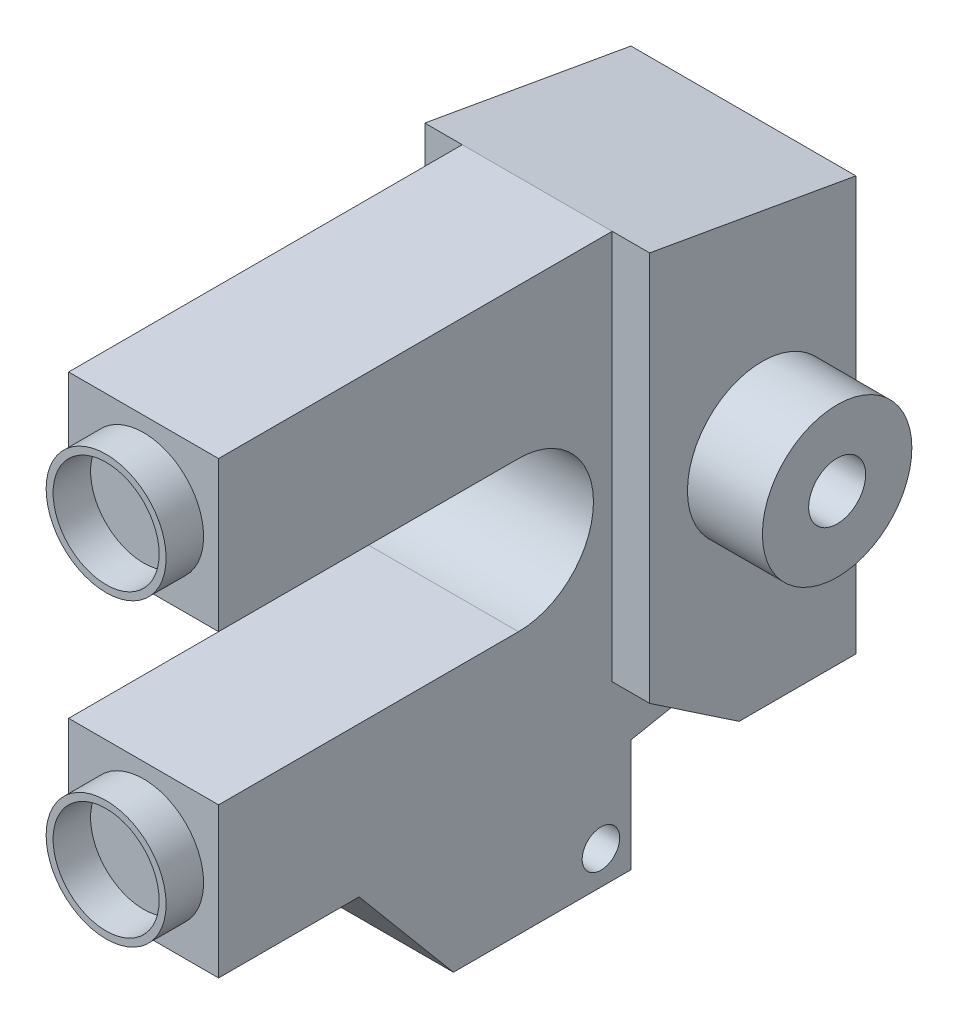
ISO-10303-21;
HEADER;
FILE_DESCRIPTION(('STEP AP214'),'2;1');
FILE_NAME('part.step','',(''),(''),'','','');
FILE_SCHEMA(('AUTOMOTIVE_DESIGN { 1 0 10303 214 1 1 1 1 }'));
ENDSEC;
DATA;
#1=APPLICATION_CONTEXT('core data for automotive mechanical design processes');
#2=APPLICATION_PROTOCOL_DEFINITION('international standard','automotive_design',2000,#1);
#3=PRODUCT_CONTEXT('',#1,'mechanical');
#4=PRODUCT('Part','Part','',(#3));
#5=PRODUCT_RELATED_PRODUCT_CATEGORY('part','',(#4));
#6=PRODUCT_DEFINITION_FORMATION('','',#4);
#7=PRODUCT_DEFINITION_CONTEXT('part definition',#1,'design');
#8=PRODUCT_DEFINITION('design','',#6,#7);
#9=PRODUCT_DEFINITION_SHAPE('','',#8);
#10=(LENGTH_UNIT() NAMED_UNIT(*) SI_UNIT(.MILLI.,.METRE.));
#11=(NAMED_UNIT(*) PLANE_ANGLE_UNIT() SI_UNIT($,.RADIAN.));
#12=(NAMED_UNIT(*) SI_UNIT($,.STERADIAN.) SOLID_ANGLE_UNIT());
#13=UNCERTAINTY_MEASURE_WITH_UNIT(LENGTH_MEASURE(1.E-05),#10,'distance_accuracy_value','');
#14=(GEOMETRIC_REPRESENTATION_CONTEXT(3) GLOBAL_UNCERTAINTY_ASSIGNED_CONTEXT((#13)) GLOBAL_UNIT_ASSIGNED_CONTEXT((#10,
#11,#12)) REPRESENTATION_CONTEXT('',''));
#15=CARTESIAN_POINT('',(0.,0.,0.));
#16=DIRECTION('',(0.,0.,1.));
#17=DIRECTION('',(1.,0.,0.));
#18=AXIS2_PLACEMENT_3D('',#15,#16,#17);
#19=CARTESIAN_POINT('',(6.35,0.,0.));
#20=DIRECTION('',(0.,0.,-1.));
#21=DIRECTION('',(-1.,0.,0.));
#22=AXIS2_PLACEMENT_3D('',#19,#20,#21);
#23=PLANE('',#22);
#24=DIRECTION('',(0.,-1.,0.));
#25=VECTOR('',#24,1.);
#26=CARTESIAN_POINT('',(6.35,0.,0.));
#27=LINE('',#26,#25);
#28=CARTESIAN_POINT('',(6.35,12.7,0.));
#29=VERTEX_POINT('',#28);
#30=CARTESIAN_POINT('',(6.35,0.,0.));
#31=VERTEX_POINT('',#30);
#32=EDGE_CURVE('E667',#29,#31,#27,.T.);
#33=ORIENTED_EDGE('',*,*,#32,.F.);
#34=DIRECTION('',(1.,0.,0.));
#35=VECTOR('',#34,1.);
#36=CARTESIAN_POINT('',(-6.35,12.7,0.));
#37=LINE('',#36,#35);
#38=CARTESIAN_POINT('',(-6.35,12.7,0.));
#39=VERTEX_POINT('',#38);
#40=EDGE_CURVE('E331',#39,#29,#37,.T.);
#41=ORIENTED_EDGE('',*,*,#40,.F.);
#42=DIRECTION('',(0.,-1.,0.));
#43=VECTOR('',#42,1.);
#44=CARTESIAN_POINT('',(-6.35,0.,0.));
#45=LINE('',#44,#43);
#46=CARTESIAN_POINT('',(-6.35,0.,0.));
#47=VERTEX_POINT('',#46);
#48=EDGE_CURVE('E396',#39,#47,#45,.T.);
#49=ORIENTED_EDGE('',*,*,#48,.T.);
#50=DIRECTION('',(-1.,0.,0.));
#51=VECTOR('',#50,1.);
#52=CARTESIAN_POINT('',(6.35,0.,0.));
#53=LINE('',#52,#51);
#54=EDGE_CURVE('E399',#31,#47,#53,.T.);
#55=ORIENTED_EDGE('',*,*,#54,.F.);
#56=EDGE_LOOP('',(#33,#41,#49,#55));
#57=FACE_BOUND('',#56,.T.);
#58=CARTESIAN_POINT('',(0.,6.35,0.));
#59=DIRECTION('',(0.,0.,-1.));
#60=DIRECTION('',(-1.,0.,0.));
#61=AXIS2_PLACEMENT_3D('',#58,#59,#60);
#62=CIRCLE('',#61,5.08);
#63=CARTESIAN_POINT('',(-5.08,6.35,0.));
#64=VERTEX_POINT('',#63);
#65=EDGE_CURVE('E11',#64,#64,#62,.F.);
#66=ORIENTED_EDGE('',*,*,#65,.F.);
#67=EDGE_LOOP('',(#66));
#68=FACE_BOUND('',#67,.T.);
#69=ADVANCED_FACE('F34',(#57,#68),#23,.F.);
#70=CARTESIAN_POINT('',(-6.35,38.1,0.));
#71=VERTEX_POINT('',#70);
#72=CARTESIAN_POINT('',(-6.35,25.4,0.));
#73=VERTEX_POINT('',#72);
#74=EDGE_CURVE('E352',#71,#73,#45,.T.);
#75=ORIENTED_EDGE('',*,*,#74,.T.);
#76=DIRECTION('',(1.,0.,0.));
#77=VECTOR('',#76,1.);
#78=CARTESIAN_POINT('',(-6.35,25.4,0.));
#79=LINE('',#78,#77);
#80=CARTESIAN_POINT('',(6.35,25.4,0.));
#81=VERTEX_POINT('',#80);
#82=EDGE_CURVE('E339',#73,#81,#79,.T.);
#83=ORIENTED_EDGE('',*,*,#82,.T.);
#84=CARTESIAN_POINT('',(6.35,38.1,0.));
#85=VERTEX_POINT('',#84);
#86=EDGE_CURVE('E403',#85,#81,#27,.T.);
#87=ORIENTED_EDGE('',*,*,#86,.F.);
#88=DIRECTION('',(-1.,0.,0.));
#89=VECTOR('',#88,1.);
#90=CARTESIAN_POINT('',(6.35,38.1,0.));
#91=LINE('',#90,#89);
#92=EDGE_CURVE('E402',#85,#71,#91,.T.);
#93=ORIENTED_EDGE('',*,*,#92,.T.);
#94=EDGE_LOOP('',(#75,#83,#87,#93));
#95=FACE_BOUND('',#94,.T.);
#96=CARTESIAN_POINT('',(0.,31.75,0.));
#97=DIRECTION('',(0.,0.,-1.));
#98=DIRECTION('',(-1.,0.,0.));
#99=AXIS2_PLACEMENT_3D('',#96,#97,#98);
#100=CIRCLE('',#99,5.08);
#101=CARTESIAN_POINT('',(-5.08,31.75,0.));
#102=VERTEX_POINT('',#101);
#103=EDGE_CURVE('E42',#102,#102,#100,.F.);
#104=ORIENTED_EDGE('',*,*,#103,.F.);
#105=EDGE_LOOP('',(#104));
#106=FACE_BOUND('',#105,.T.);
#107=ADVANCED_FACE('F480',(#95,#106),#23,.F.);
#108=CARTESIAN_POINT('',(6.35,0.,-34.925));
#109=DIRECTION('',(0.,0.,1.));
#110=DIRECTION('',(1.,0.,0.));
#111=AXIS2_PLACEMENT_3D('',#108,#109,#110);
#112=PLANE('',#111);
#113=DIRECTION('',(-1.,0.,0.));
#114=VECTOR('',#113,1.);
#115=CARTESIAN_POINT('',(6.35,-9.525,-34.925));
#116=LINE('',#115,#114);
#117=CARTESIAN_POINT('',(6.35,-9.525,-34.925));
#118=VERTEX_POINT('',#117);
#119=CARTESIAN_POINT('',(3.17500000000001,-9.525,-34.925));
#120=VERTEX_POINT('',#119);
#121=EDGE_CURVE('E415',#118,#120,#116,.T.);
#122=ORIENTED_EDGE('',*,*,#121,.T.);
#123=DIRECTION('',(0.,-1.,0.));
#124=VECTOR('',#123,1.);
#125=CARTESIAN_POINT('',(3.17500000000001,1.5875,-34.925));
#126=LINE('',#125,#124);
#127=CARTESIAN_POINT('',(3.17500000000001,0.,-34.925));
#128=VERTEX_POINT('',#127);
#129=EDGE_CURVE('E247',#128,#120,#126,.T.);
#130=ORIENTED_EDGE('',*,*,#129,.F.);
#131=DIRECTION('',(-1.,0.,0.));
#132=VECTOR('',#131,1.);
#133=CARTESIAN_POINT('',(6.35,0.,-34.925));
#134=LINE('',#133,#132);
#135=CARTESIAN_POINT('',(6.35,0.,-34.925));
#136=VERTEX_POINT('',#135);
#137=EDGE_CURVE('E410',#136,#128,#134,.T.);
#138=ORIENTED_EDGE('',*,*,#137,.F.);
#139=DIRECTION('',(0.,1.,0.));
#140=VECTOR('',#139,1.);
#141=CARTESIAN_POINT('',(6.35,0.,-34.925));
#142=LINE('',#141,#140);
#143=EDGE_CURVE('E356',#118,#136,#142,.T.);
#144=ORIENTED_EDGE('',*,*,#143,.F.);
#145=EDGE_LOOP('',(#122,#130,#138,#144));
#146=FACE_BOUND('',#145,.T.);
#147=ADVANCED_FACE('F460',(#146),#112,.F.);
#148=CARTESIAN_POINT('',(-9.525,35.0208900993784,-50.8));
#149=DIRECTION('',(1.,0.,0.));
#150=DIRECTION('',(0.,0.,1.));
#151=AXIS2_PLACEMENT_3D('',#148,#149,#150);
#152=PLANE('',#151);
#153=DIRECTION('',(0.,0.173648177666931,0.984807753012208));
#154=VECTOR('',#153,1.);
#155=CARTESIAN_POINT('',(-9.525,38.1,-33.3375));
#156=LINE('',#155,#154);
#157=CARTESIAN_POINT('',(-9.525,35.0208900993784,-50.8));
#158=VERTEX_POINT('',#157);
#159=CARTESIAN_POINT('',(-9.525,38.1,-33.3375));
#160=VERTEX_POINT('',#159);
#161=EDGE_CURVE('E260',#158,#160,#156,.T.);
#162=ORIENTED_EDGE('',*,*,#161,.F.);
#163=DIRECTION('',(0.,1.,0.));
#164=VECTOR('',#163,1.);
#165=CARTESIAN_POINT('',(-9.525,35.0208900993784,-50.8));
#166=LINE('',#165,#164);
#167=CARTESIAN_POINT('',(-9.525,-0.0451519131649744,-50.8));
#168=VERTEX_POINT('',#167);
#169=EDGE_CURVE('E263',#168,#158,#166,.T.);
#170=ORIENTED_EDGE('',*,*,#169,.F.);
#171=DIRECTION('',(0.,0.,-1.));
#172=VECTOR('',#171,1.);
#173=CARTESIAN_POINT('',(-9.525,-0.0451519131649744,-40.9066319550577));
#174=LINE('',#173,#172);
#175=CARTESIAN_POINT('',(-9.525,-0.0451519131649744,-40.9066319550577));
#176=VERTEX_POINT('',#175);
#177=EDGE_CURVE('E267',#176,#168,#174,.T.);
#178=ORIENTED_EDGE('',*,*,#177,.F.);
#179=DIRECTION('',(0.,-0.559192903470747,-0.829037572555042));
#180=VECTOR('',#179,1.);
#181=CARTESIAN_POINT('',(-9.525,5.06029205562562,-33.3375));
#182=LINE('',#181,#180);
#183=CARTESIAN_POINT('',(-9.525,5.06029205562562,-33.3375));
#184=VERTEX_POINT('',#183);
#185=EDGE_CURVE('E270',#184,#176,#182,.T.);
#186=ORIENTED_EDGE('',*,*,#185,.F.);
#187=DIRECTION('',(0.,-1.,0.));
#188=VECTOR('',#187,1.);
#189=CARTESIAN_POINT('',(-9.525,38.1,-33.3375));
#190=LINE('',#189,#188);
#191=EDGE_CURVE('E273',#160,#184,#190,.T.);
#192=ORIENTED_EDGE('',*,*,#191,.F.);
#193=EDGE_LOOP('',(#162,#170,#178,#186,#192));
#194=FACE_BOUND('',#193,.T.);
#195=CARTESIAN_POINT('',(-9.525,19.05,-42.8625));
#196=DIRECTION('',(1.,0.,0.));
#197=DIRECTION('',(0.,0.,-1.));
#198=AXIS2_PLACEMENT_3D('',#195,#196,#197);
#199=CIRCLE('',#198,6.35);
#200=CARTESIAN_POINT('',(-9.525,19.05,-49.2125));
#201=VERTEX_POINT('',#200);
#202=EDGE_CURVE('E381',#201,#201,#199,.F.);
#203=ORIENTED_EDGE('',*,*,#202,.F.);
#204=EDGE_LOOP('',(#203));
#205=FACE_BOUND('',#204,.T.);
#206=ADVANCED_FACE('F548',(#194,#205),#152,.F.);
#207=CARTESIAN_POINT('',(-6.35,0.,0.));
#208=DIRECTION('',(-1.,0.,0.));
#209=DIRECTION('',(0.,0.,1.));
#210=AXIS2_PLACEMENT_3D('',#207,#208,#209);
#211=PLANE('',#210);
#212=CARTESIAN_POINT('',(-6.35,-6.69796522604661,-32.3839750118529));
#213=DIRECTION('',(-1.,0.,0.));
#214=DIRECTION('',(0.,0.,1.));
#215=AXIS2_PLACEMENT_3D('',#212,#213,#214);
#216=CIRCLE('',#215,1.58750000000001);
#217=CARTESIAN_POINT('',(-6.35,-6.69796522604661,-30.7964750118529));
#218=VERTEX_POINT('',#217);
#219=EDGE_CURVE('E237',#218,#218,#216,.T.);
#220=ORIENTED_EDGE('',*,*,#219,.F.);
#221=EDGE_LOOP('',(#220));
#222=FACE_BOUND('',#221,.T.);
#223=DIRECTION('',(0.,0.,1.));
#224=VECTOR('',#223,1.);
#225=CARTESIAN_POINT('',(-6.35,38.1,0.));
#226=LINE('',#225,#224);
#227=CARTESIAN_POINT('',(-6.35,38.1,-33.3375));
#228=VERTEX_POINT('',#227);
#229=EDGE_CURVE('E393',#228,#71,#226,.T.);
#230=ORIENTED_EDGE('',*,*,#229,.F.);
#231=DIRECTION('',(0.,-1.,0.));
#232=VECTOR('',#231,1.);
#233=CARTESIAN_POINT('',(-6.35,38.1,-33.3375));
#234=LINE('',#233,#232);
#235=CARTESIAN_POINT('',(-6.35,5.06029205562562,-33.3375));
#236=VERTEX_POINT('',#235);
#237=EDGE_CURVE('E264',#228,#236,#234,.T.);
#238=ORIENTED_EDGE('',*,*,#237,.T.);
#239=DIRECTION('',(0.,-0.559192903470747,-0.829037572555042));
#240=VECTOR('',#239,1.);
#241=CARTESIAN_POINT('',(-6.35,5.06029205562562,-33.3375));
#242=LINE('',#241,#240);
#243=CARTESIAN_POINT('',(-6.35,0.892498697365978,-39.5165077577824));
#244=VERTEX_POINT('',#243);
#245=EDGE_CURVE('E452',#236,#244,#242,.T.);
#246=ORIENTED_EDGE('',*,*,#245,.T.);
#247=DIRECTION('',(0.,0.190808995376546,-0.981627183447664));
#248=VECTOR('',#247,1.);
#249=CARTESIAN_POINT('',(-6.35,3.0857874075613,-50.8));
#250=LINE('',#249,#248);
#251=CARTESIAN_POINT('',(-6.35,0.,-34.925));
#252=VERTEX_POINT('',#251);
#253=EDGE_CURVE('E386',#252,#244,#250,.T.);
#254=ORIENTED_EDGE('',*,*,#253,.F.);
#255=DIRECTION('',(0.,1.,0.));
#256=VECTOR('',#255,1.);
#257=CARTESIAN_POINT('',(-6.35,0.,-34.925));
#258=LINE('',#257,#256);
#259=CARTESIAN_POINT('',(-6.35,-9.525,-34.925));
#260=VERTEX_POINT('',#259);
#261=EDGE_CURVE('E387',#260,#252,#258,.T.);
#262=ORIENTED_EDGE('',*,*,#261,.F.);
#263=DIRECTION('',(0.,0.,-1.));
#264=VECTOR('',#263,1.);
#265=CARTESIAN_POINT('',(-6.35,-9.525,-34.925));
#266=LINE('',#265,#264);
#267=CARTESIAN_POINT('',(-6.35,-9.525,-19.889951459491));
#268=VERTEX_POINT('',#267);
#269=EDGE_CURVE('E437',#268,#260,#266,.T.);
#270=ORIENTED_EDGE('',*,*,#269,.F.);
#271=DIRECTION('',(0.,-0.766044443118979,-0.642787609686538));
#272=VECTOR('',#271,1.);
#273=CARTESIAN_POINT('',(-6.35,-9.525,-19.889951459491));
#274=LINE('',#273,#272);
#275=CARTESIAN_POINT('',(-6.35,0.,-11.8975274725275));
#276=VERTEX_POINT('',#275);
#277=EDGE_CURVE('E429',#276,#268,#274,.T.);
#278=ORIENTED_EDGE('',*,*,#277,.F.);
#279=DIRECTION('',(0.,0.,-1.));
#280=VECTOR('',#279,1.);
#281=CARTESIAN_POINT('',(-6.35,0.,-11.8975274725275));
#282=LINE('',#281,#280);
#283=EDGE_CURVE('E342',#47,#276,#282,.T.);
#284=ORIENTED_EDGE('',*,*,#283,.F.);
#285=ORIENTED_EDGE('',*,*,#48,.F.);
#286=DIRECTION('',(0.,0.,-1.));
#287=VECTOR('',#286,1.);
#288=CARTESIAN_POINT('',(-6.35,12.7,0.));
#289=LINE('',#288,#287);
#290=CARTESIAN_POINT('',(-6.35,12.7,-25.4));
#291=VERTEX_POINT('',#290);
#292=EDGE_CURVE('E321',#39,#291,#289,.T.);
#293=ORIENTED_EDGE('',*,*,#292,.T.);
#294=CARTESIAN_POINT('',(-6.35,19.05,-25.4));
#295=DIRECTION('',(1.,0.,0.));
#296=DIRECTION('',(0.,0.,-1.));
#297=AXIS2_PLACEMENT_3D('',#294,#295,#296);
#298=CIRCLE('',#297,6.35);
#299=CARTESIAN_POINT('',(-6.35,25.4,-25.4));
#300=VERTEX_POINT('',#299);
#301=EDGE_CURVE('E324',#291,#300,#298,.T.);
#302=ORIENTED_EDGE('',*,*,#301,.T.);
#303=DIRECTION('',(0.,0.,1.));
#304=VECTOR('',#303,1.);
#305=CARTESIAN_POINT('',(-6.35,25.4,0.));
#306=LINE('',#305,#304);
#307=EDGE_CURVE('E328',#300,#73,#306,.T.);
#308=ORIENTED_EDGE('',*,*,#307,.T.);
#309=ORIENTED_EDGE('',*,*,#74,.F.);
#310=EDGE_LOOP('',(#230,#238,#246,#254,#262,#270,#278,#284,#285,#293,#302,#308,#309));
#311=FACE_BOUND('',#310,.T.);
#312=ADVANCED_FACE('F450',(#222,#311),#211,.T.);
#313=CARTESIAN_POINT('',(9.525,35.0208900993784,-50.8));
#314=DIRECTION('',(-1.,0.,0.));
#315=DIRECTION('',(0.,0.,1.));
#316=AXIS2_PLACEMENT_3D('',#313,#314,#315);
#317=PLANE('',#316);
#318=DIRECTION('',(0.,0.173648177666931,0.984807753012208));
#319=VECTOR('',#318,1.);
#320=CARTESIAN_POINT('',(9.525,38.1,-33.3375));
#321=LINE('',#320,#319);
#322=CARTESIAN_POINT('',(9.525,35.0208900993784,-50.8));
#323=VERTEX_POINT('',#322);
#324=CARTESIAN_POINT('',(9.525,38.1,-33.3375));
#325=VERTEX_POINT('',#324);
#326=EDGE_CURVE('E290',#323,#325,#321,.T.);
#327=ORIENTED_EDGE('',*,*,#326,.T.);
#328=DIRECTION('',(0.,-1.,0.));
#329=VECTOR('',#328,1.);
#330=CARTESIAN_POINT('',(9.525,38.1,-33.3375));
#331=LINE('',#330,#329);
#332=CARTESIAN_POINT('',(9.525,5.06029205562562,-33.3375));
#333=VERTEX_POINT('',#332);
#334=EDGE_CURVE('E293',#325,#333,#331,.T.);
#335=ORIENTED_EDGE('',*,*,#334,.T.);
#336=DIRECTION('',(0.,-0.559192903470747,-0.829037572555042));
#337=VECTOR('',#336,1.);
#338=CARTESIAN_POINT('',(9.525,5.06029205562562,-33.3375));
#339=LINE('',#338,#337);
#340=CARTESIAN_POINT('',(9.525,-0.0451519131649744,-40.9066319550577));
#341=VERTEX_POINT('',#340);
#342=EDGE_CURVE('E296',#333,#341,#339,.T.);
#343=ORIENTED_EDGE('',*,*,#342,.T.);
#344=DIRECTION('',(0.,0.,-1.));
#345=VECTOR('',#344,1.);
#346=CARTESIAN_POINT('',(9.525,-0.0451519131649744,-40.9066319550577));
#347=LINE('',#346,#345);
#348=CARTESIAN_POINT('',(9.525,-0.0451519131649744,-50.8));
#349=VERTEX_POINT('',#348);
#350=EDGE_CURVE('E298',#341,#349,#347,.T.);
#351=ORIENTED_EDGE('',*,*,#350,.T.);
#352=DIRECTION('',(0.,1.,0.));
#353=VECTOR('',#352,1.);
#354=CARTESIAN_POINT('',(9.525,35.0208900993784,-50.8));
#355=LINE('',#354,#353);
#356=EDGE_CURVE('E300',#349,#323,#355,.T.);
#357=ORIENTED_EDGE('',*,*,#356,.T.);
#358=EDGE_LOOP('',(#327,#335,#343,#351,#357));
#359=FACE_BOUND('',#358,.T.);
#360=CARTESIAN_POINT('',(9.525,19.05,-42.8625));
#361=DIRECTION('',(-1.,0.,0.));
#362=DIRECTION('',(0.,0.,1.));
#363=AXIS2_PLACEMENT_3D('',#360,#361,#362);
#364=CIRCLE('',#363,6.32872171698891);
#365=CARTESIAN_POINT('',(9.525,19.05,-36.5337782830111));
#366=VERTEX_POINT('',#365);
#367=EDGE_CURVE('E378',#366,#366,#364,.F.);
#368=ORIENTED_EDGE('',*,*,#367,.F.);
#369=EDGE_LOOP('',(#368));
#370=FACE_BOUND('',#369,.T.);
#371=ADVANCED_FACE('F556',(#359,#370),#317,.F.);
#372=CARTESIAN_POINT('',(6.35,0.,0.));
#373=DIRECTION('',(-1.,0.,0.));
#374=DIRECTION('',(0.,0.,1.));
#375=AXIS2_PLACEMENT_3D('',#372,#373,#374);
#376=PLANE('',#375);
#377=CARTESIAN_POINT('',(6.35,-6.69796522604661,-32.3839750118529));
#378=DIRECTION('',(1.,0.,0.));
#379=DIRECTION('',(0.,0.,-1.));
#380=AXIS2_PLACEMENT_3D('',#377,#378,#379);
#381=CIRCLE('',#380,1.58750000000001);
#382=CARTESIAN_POINT('',(6.35,-6.69796522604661,-33.9714750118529));
#383=VERTEX_POINT('',#382);
#384=EDGE_CURVE('E532',#383,#383,#381,.T.);
#385=ORIENTED_EDGE('',*,*,#384,.F.);
#386=EDGE_LOOP('',(#385));
#387=FACE_BOUND('',#386,.T.);
#388=DIRECTION('',(0.,-0.559192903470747,-0.829037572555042));
#389=VECTOR('',#388,1.);
#390=CARTESIAN_POINT('',(6.35,5.06029205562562,-33.3375));
#391=LINE('',#390,#389);
#392=CARTESIAN_POINT('',(6.35,5.06029205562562,-33.3375));
#393=VERTEX_POINT('',#392);
#394=CARTESIAN_POINT('',(6.35,0.892498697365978,-39.5165077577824));
#395=VERTEX_POINT('',#394);
#396=EDGE_CURVE('E307',#393,#395,#391,.T.);
#397=ORIENTED_EDGE('',*,*,#396,.F.);
#398=DIRECTION('',(0.,-1.,0.));
#399=VECTOR('',#398,1.);
#400=CARTESIAN_POINT('',(6.35,38.1,-33.3375));
#401=LINE('',#400,#399);
#402=CARTESIAN_POINT('',(6.35,38.1,-33.3375));
#403=VERTEX_POINT('',#402);
#404=EDGE_CURVE('E289',#403,#393,#401,.T.);
#405=ORIENTED_EDGE('',*,*,#404,.F.);
#406=DIRECTION('',(0.,0.,1.));
#407=VECTOR('',#406,1.);
#408=CARTESIAN_POINT('',(6.35,38.1,0.));
#409=LINE('',#408,#407);
#410=EDGE_CURVE('E363',#403,#85,#409,.T.);
#411=ORIENTED_EDGE('',*,*,#410,.T.);
#412=ORIENTED_EDGE('',*,*,#86,.T.);
#413=DIRECTION('',(0.,0.,1.));
#414=VECTOR('',#413,1.);
#415=CARTESIAN_POINT('',(6.35,25.4,0.));
#416=LINE('',#415,#414);
#417=CARTESIAN_POINT('',(6.35,25.4,-25.4));
#418=VERTEX_POINT('',#417);
#419=EDGE_CURVE('E325',#418,#81,#416,.T.);
#420=ORIENTED_EDGE('',*,*,#419,.F.);
#421=CARTESIAN_POINT('',(6.35,19.05,-25.4));
#422=DIRECTION('',(1.,0.,0.));
#423=DIRECTION('',(0.,0.,-1.));
#424=AXIS2_PLACEMENT_3D('',#421,#422,#423);
#425=CIRCLE('',#424,6.35);
#426=CARTESIAN_POINT('',(6.35,12.7,-25.4));
#427=VERTEX_POINT('',#426);
#428=EDGE_CURVE('E335',#427,#418,#425,.T.);
#429=ORIENTED_EDGE('',*,*,#428,.F.);
#430=DIRECTION('',(0.,0.,-1.));
#431=VECTOR('',#430,1.);
#432=CARTESIAN_POINT('',(6.35,12.7,0.));
#433=LINE('',#432,#431);
#434=EDGE_CURVE('E332',#29,#427,#433,.T.);
#435=ORIENTED_EDGE('',*,*,#434,.F.);
#436=ORIENTED_EDGE('',*,*,#32,.T.);
#437=DIRECTION('',(0.,0.,-1.));
#438=VECTOR('',#437,1.);
#439=CARTESIAN_POINT('',(6.35,0.,-11.8975274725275));
#440=LINE('',#439,#438);
#441=CARTESIAN_POINT('',(6.35,0.,-11.8975274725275));
#442=VERTEX_POINT('',#441);
#443=EDGE_CURVE('E348',#31,#442,#440,.T.);
#444=ORIENTED_EDGE('',*,*,#443,.T.);
#445=DIRECTION('',(0.,-0.766044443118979,-0.642787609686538));
#446=VECTOR('',#445,1.);
#447=CARTESIAN_POINT('',(6.35,-9.525,-19.889951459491));
#448=LINE('',#447,#446);
#449=CARTESIAN_POINT('',(6.35,-9.525,-19.889951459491));
#450=VERTEX_POINT('',#449);
#451=EDGE_CURVE('E351',#442,#450,#448,.T.);
#452=ORIENTED_EDGE('',*,*,#451,.T.);
#453=DIRECTION('',(0.,0.,-1.));
#454=VECTOR('',#453,1.);
#455=CARTESIAN_POINT('',(6.35,-9.525,-34.925));
#456=LINE('',#455,#454);
#457=EDGE_CURVE('E354',#450,#118,#456,.T.);
#458=ORIENTED_EDGE('',*,*,#457,.T.);
#459=ORIENTED_EDGE('',*,*,#143,.T.);
#460=DIRECTION('',(0.,0.190808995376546,-0.981627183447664));
#461=VECTOR('',#460,1.);
#462=CARTESIAN_POINT('',(6.35,3.0857874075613,-50.8));
#463=LINE('',#462,#461);
#464=EDGE_CURVE('E359',#136,#395,#463,.T.);
#465=ORIENTED_EDGE('',*,*,#464,.T.);
#466=EDGE_LOOP('',(#397,#405,#411,#412,#420,#429,#435,#436,#444,#452,#458,#459,#465));
#467=FACE_BOUND('',#466,.T.);
#468=ADVANCED_FACE('F589',(#387,#467),#376,.F.);
#469=CARTESIAN_POINT('',(6.35,0.,-11.8975274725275));
#470=DIRECTION('',(0.,1.,0.));
#471=DIRECTION('',(0.,0.,1.));
#472=AXIS2_PLACEMENT_3D('',#469,#470,#471);
#473=PLANE('',#472);
#474=ORIENTED_EDGE('',*,*,#283,.T.);
#475=DIRECTION('',(-1.,0.,0.));
#476=VECTOR('',#475,1.);
#477=CARTESIAN_POINT('',(6.35,0.,-11.8975274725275));
#478=LINE('',#477,#476);
#479=EDGE_CURVE('E369',#442,#276,#478,.T.);
#480=ORIENTED_EDGE('',*,*,#479,.F.);
#481=ORIENTED_EDGE('',*,*,#443,.F.);
#482=ORIENTED_EDGE('',*,*,#54,.T.);
#483=EDGE_LOOP('',(#474,#480,#481,#482));
#484=FACE_BOUND('',#483,.T.);
#485=ADVANCED_FACE('F36',(#484),#473,.F.);
#486=CARTESIAN_POINT('',(6.35,-9.525,-19.889951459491));
#487=DIRECTION('',(0.,0.642787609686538,-0.766044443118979));
#488=DIRECTION('',(0.,0.766044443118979,0.642787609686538));
#489=AXIS2_PLACEMENT_3D('',#486,#487,#488);
#490=PLANE('',#489);
#491=ORIENTED_EDGE('',*,*,#277,.T.);
#492=DIRECTION('',(-1.,0.,0.));
#493=VECTOR('',#492,1.);
#494=CARTESIAN_POINT('',(6.35,-9.525,-19.889951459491));
#495=LINE('',#494,#493);
#496=EDGE_CURVE('E417',#450,#268,#495,.T.);
#497=ORIENTED_EDGE('',*,*,#496,.F.);
#498=ORIENTED_EDGE('',*,*,#451,.F.);
#499=ORIENTED_EDGE('',*,*,#479,.T.);
#500=EDGE_LOOP('',(#491,#497,#498,#499));
#501=FACE_BOUND('',#500,.T.);
#502=ADVANCED_FACE('F428',(#501),#490,.F.);
#503=CARTESIAN_POINT('',(6.35,-9.525,-34.925));
#504=DIRECTION('',(0.,1.,0.));
#505=DIRECTION('',(0.,0.,1.));
#506=AXIS2_PLACEMENT_3D('',#503,#504,#505);
#507=PLANE('',#506);
#508=DIRECTION('',(-1.,0.,0.));
#509=VECTOR('',#508,1.);
#510=CARTESIAN_POINT('',(-3.17499999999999,-9.525,-22.225));
#511=LINE('',#510,#509);
#512=CARTESIAN_POINT('',(3.17500000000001,-9.525,-22.225));
#513=VERTEX_POINT('',#512);
#514=CARTESIAN_POINT('',(-3.17499999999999,-9.525,-22.225));
#515=VERTEX_POINT('',#514);
#516=EDGE_CURVE('E234',#513,#515,#511,.T.);
#517=ORIENTED_EDGE('',*,*,#516,.F.);
#518=DIRECTION('',(0.,0.,1.));
#519=VECTOR('',#518,1.);
#520=CARTESIAN_POINT('',(3.17500000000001,-9.525,-34.925));
#521=LINE('',#520,#519);
#522=EDGE_CURVE('E216',#120,#513,#521,.T.);
#523=ORIENTED_EDGE('',*,*,#522,.F.);
#524=ORIENTED_EDGE('',*,*,#121,.F.);
#525=ORIENTED_EDGE('',*,*,#457,.F.);
#526=ORIENTED_EDGE('',*,*,#496,.T.);
#527=ORIENTED_EDGE('',*,*,#269,.T.);
#528=CARTESIAN_POINT('',(-3.17499999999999,-9.525,-34.925));
#529=VERTEX_POINT('',#528);
#530=EDGE_CURVE('E413',#529,#260,#116,.T.);
#531=ORIENTED_EDGE('',*,*,#530,.F.);
#532=DIRECTION('',(0.,0.,-1.));
#533=VECTOR('',#532,1.);
#534=CARTESIAN_POINT('',(-3.17499999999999,-9.525,-34.925));
#535=LINE('',#534,#533);
#536=EDGE_CURVE('E232',#515,#529,#535,.T.);
#537=ORIENTED_EDGE('',*,*,#536,.F.);
#538=EDGE_LOOP('',(#517,#523,#524,#525,#526,#527,#531,#537));
#539=FACE_BOUND('',#538,.T.);
#540=ADVANCED_FACE('F463',(#539),#507,.F.);
#541=CARTESIAN_POINT('',(-3.17499999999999,0.,-34.925));
#542=VERTEX_POINT('',#541);
#543=EDGE_CURVE('E374',#542,#252,#134,.T.);
#544=ORIENTED_EDGE('',*,*,#543,.F.);
#545=DIRECTION('',(0.,-1.,0.));
#546=VECTOR('',#545,1.);
#547=CARTESIAN_POINT('',(-3.17499999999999,1.5875,-34.925));
#548=LINE('',#547,#546);
#549=EDGE_CURVE('E249',#542,#529,#548,.T.);
#550=ORIENTED_EDGE('',*,*,#549,.T.);
#551=ORIENTED_EDGE('',*,*,#530,.T.);
#552=ORIENTED_EDGE('',*,*,#261,.T.);
#553=EDGE_LOOP('',(#544,#550,#551,#552));
#554=FACE_BOUND('',#553,.T.);
#555=ADVANCED_FACE('F445',(#554),#112,.F.);
#556=CARTESIAN_POINT('',(6.35,3.0857874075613,-50.8));
#557=DIRECTION('',(0.,0.981627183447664,0.190808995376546));
#558=DIRECTION('',(0.,-0.190808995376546,0.981627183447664));
#559=AXIS2_PLACEMENT_3D('',#556,#557,#558);
#560=PLANE('',#559);
#561=ORIENTED_EDGE('',*,*,#253,.T.);
#562=CARTESIAN_POINT('',(-6.35,3.0857874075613,-50.8));
#563=VERTEX_POINT('',#562);
#564=EDGE_CURVE('E382',#244,#563,#250,.T.);
#565=ORIENTED_EDGE('',*,*,#564,.T.);
#566=DIRECTION('',(-1.,0.,0.));
#567=VECTOR('',#566,1.);
#568=CARTESIAN_POINT('',(6.35,3.0857874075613,-50.8));
#569=LINE('',#568,#567);
#570=CARTESIAN_POINT('',(6.35,3.0857874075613,-50.8));
#571=VERTEX_POINT('',#570);
#572=EDGE_CURVE('E371',#571,#563,#569,.T.);
#573=ORIENTED_EDGE('',*,*,#572,.F.);
#574=EDGE_CURVE('E358',#395,#571,#463,.T.);
#575=ORIENTED_EDGE('',*,*,#574,.F.);
#576=ORIENTED_EDGE('',*,*,#464,.F.);
#577=ORIENTED_EDGE('',*,*,#137,.T.);
#578=EDGE_CURVE('E414',#128,#542,#134,.T.);
#579=ORIENTED_EDGE('',*,*,#578,.T.);
#580=ORIENTED_EDGE('',*,*,#543,.T.);
#581=EDGE_LOOP('',(#561,#565,#573,#575,#576,#577,#579,#580));
#582=FACE_BOUND('',#581,.T.);
#583=ADVANCED_FACE('F454',(#582),#560,.F.);
#584=CARTESIAN_POINT('',(6.35,35.0208900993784,-50.8));
#585=DIRECTION('',(0.,0.,1.));
#586=DIRECTION('',(0.,-1.,0.));
#587=AXIS2_PLACEMENT_3D('',#584,#585,#586);
#588=PLANE('',#587);
#589=ORIENTED_EDGE('',*,*,#572,.T.);
#590=DIRECTION('',(0.,1.,0.));
#591=VECTOR('',#590,1.);
#592=CARTESIAN_POINT('',(-6.35,35.0208900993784,-50.8));
#593=LINE('',#592,#591);
#594=CARTESIAN_POINT('',(-6.35,-0.0451519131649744,-50.8));
#595=VERTEX_POINT('',#594);
#596=EDGE_CURVE('E259',#595,#563,#593,.T.);
#597=ORIENTED_EDGE('',*,*,#596,.F.);
#598=DIRECTION('',(1.,0.,0.));
#599=VECTOR('',#598,1.);
#600=CARTESIAN_POINT('',(-9.525,-0.0451519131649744,-50.8));
#601=LINE('',#600,#599);
#602=EDGE_CURVE('E284',#168,#595,#601,.T.);
#603=ORIENTED_EDGE('',*,*,#602,.F.);
#604=ORIENTED_EDGE('',*,*,#169,.T.);
#605=DIRECTION('',(-1.,0.,0.));
#606=VECTOR('',#605,1.);
#607=CARTESIAN_POINT('',(6.35,35.0208900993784,-50.8));
#608=LINE('',#607,#606);
#609=EDGE_CURVE('E375',#323,#158,#608,.T.);
#610=ORIENTED_EDGE('',*,*,#609,.F.);
#611=ORIENTED_EDGE('',*,*,#356,.F.);
#612=DIRECTION('',(-1.,0.,0.));
#613=VECTOR('',#612,1.);
#614=CARTESIAN_POINT('',(9.525,-0.0451519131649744,-50.8));
#615=LINE('',#614,#613);
#616=CARTESIAN_POINT('',(6.35,-0.0451519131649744,-50.8));
#617=VERTEX_POINT('',#616);
#618=EDGE_CURVE('E303',#349,#617,#615,.T.);
#619=ORIENTED_EDGE('',*,*,#618,.T.);
#620=DIRECTION('',(0.,1.,0.));
#621=VECTOR('',#620,1.);
#622=CARTESIAN_POINT('',(6.35,35.0208900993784,-50.8));
#623=LINE('',#622,#621);
#624=EDGE_CURVE('E294',#617,#571,#623,.T.);
#625=ORIENTED_EDGE('',*,*,#624,.T.);
#626=EDGE_LOOP('',(#589,#597,#603,#604,#610,#611,#619,#625));
#627=FACE_BOUND('',#626,.T.);
#628=ADVANCED_FACE('F644',(#627),#588,.F.);
#629=CARTESIAN_POINT('',(6.35,38.1,-33.3375));
#630=DIRECTION('',(0.,-0.984807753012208,0.173648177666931));
#631=DIRECTION('',(0.,-0.173648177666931,-0.984807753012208));
#632=AXIS2_PLACEMENT_3D('',#629,#630,#631);
#633=PLANE('',#632);
#634=ORIENTED_EDGE('',*,*,#609,.T.);
#635=ORIENTED_EDGE('',*,*,#161,.T.);
#636=DIRECTION('',(1.,0.,0.));
#637=VECTOR('',#636,1.);
#638=CARTESIAN_POINT('',(-9.525,38.1,-33.3375));
#639=LINE('',#638,#637);
#640=EDGE_CURVE('E276',#160,#228,#639,.T.);
#641=ORIENTED_EDGE('',*,*,#640,.T.);
#642=DIRECTION('',(-1.,0.,0.));
#643=VECTOR('',#642,1.);
#644=CARTESIAN_POINT('',(6.35,38.1,-33.3375));
#645=LINE('',#644,#643);
#646=EDGE_CURVE('E406',#403,#228,#645,.T.);
#647=ORIENTED_EDGE('',*,*,#646,.F.);
#648=DIRECTION('',(-1.,0.,0.));
#649=VECTOR('',#648,1.);
#650=CARTESIAN_POINT('',(9.525,38.1,-33.3375));
#651=LINE('',#650,#649);
#652=EDGE_CURVE('E319',#325,#403,#651,.T.);
#653=ORIENTED_EDGE('',*,*,#652,.F.);
#654=ORIENTED_EDGE('',*,*,#326,.F.);
#655=EDGE_LOOP('',(#634,#635,#641,#647,#653,#654));
#656=FACE_BOUND('',#655,.T.);
#657=ADVANCED_FACE('F661',(#656),#633,.F.);
#658=CARTESIAN_POINT('',(6.35,38.1,0.));
#659=DIRECTION('',(0.,-1.,0.));
#660=DIRECTION('',(0.,0.,-1.));
#661=AXIS2_PLACEMENT_3D('',#658,#659,#660);
#662=PLANE('',#661);
#663=ORIENTED_EDGE('',*,*,#229,.T.);
#664=ORIENTED_EDGE('',*,*,#92,.F.);
#665=ORIENTED_EDGE('',*,*,#410,.F.);
#666=ORIENTED_EDGE('',*,*,#646,.T.);
#667=EDGE_LOOP('',(#663,#664,#665,#666));
#668=FACE_BOUND('',#667,.T.);
#669=ADVANCED_FACE('F611',(#668),#662,.F.);
#670=CARTESIAN_POINT('',(-6.35,25.4,0.));
#671=DIRECTION('',(0.,1.,0.));
#672=DIRECTION('',(0.,0.,1.));
#673=AXIS2_PLACEMENT_3D('',#670,#671,#672);
#674=PLANE('',#673);
#675=ORIENTED_EDGE('',*,*,#419,.T.);
#676=ORIENTED_EDGE('',*,*,#82,.F.);
#677=ORIENTED_EDGE('',*,*,#307,.F.);
#678=DIRECTION('',(1.,0.,0.));
#679=VECTOR('',#678,1.);
#680=CARTESIAN_POINT('',(-6.35,25.4,-25.4));
#681=LINE('',#680,#679);
#682=EDGE_CURVE('E343',#300,#418,#681,.T.);
#683=ORIENTED_EDGE('',*,*,#682,.T.);
#684=EDGE_LOOP('',(#675,#676,#677,#683));
#685=FACE_BOUND('',#684,.T.);
#686=ADVANCED_FACE('F607',(#685),#674,.F.);
#687=CARTESIAN_POINT('',(-6.35,19.05,-25.4));
#688=DIRECTION('',(1.,0.,0.));
#689=DIRECTION('',(0.,0.,-1.));
#690=AXIS2_PLACEMENT_3D('',#687,#688,#689);
#691=CYLINDRICAL_SURFACE('',#690,6.35);
#692=ORIENTED_EDGE('',*,*,#428,.T.);
#693=ORIENTED_EDGE('',*,*,#682,.F.);
#694=ORIENTED_EDGE('',*,*,#301,.F.);
#695=DIRECTION('',(1.,0.,0.));
#696=VECTOR('',#695,1.);
#697=CARTESIAN_POINT('',(-6.35,12.7,-25.4));
#698=LINE('',#697,#696);
#699=EDGE_CURVE('E345',#291,#427,#698,.T.);
#700=ORIENTED_EDGE('',*,*,#699,.T.);
#701=EDGE_LOOP('',(#692,#693,#694,#700));
#702=FACE_BOUND('',#701,.T.);
#703=ADVANCED_FACE('F610',(#702),#691,.F.);
#704=CARTESIAN_POINT('',(-6.35,12.7,0.));
#705=DIRECTION('',(0.,-1.,0.));
#706=DIRECTION('',(0.,0.,-1.));
#707=AXIS2_PLACEMENT_3D('',#704,#705,#706);
#708=PLANE('',#707);
#709=ORIENTED_EDGE('',*,*,#434,.T.);
#710=ORIENTED_EDGE('',*,*,#699,.F.);
#711=ORIENTED_EDGE('',*,*,#292,.F.);
#712=ORIENTED_EDGE('',*,*,#40,.T.);
#713=EDGE_LOOP('',(#709,#710,#711,#712));
#714=FACE_BOUND('',#713,.T.);
#715=ADVANCED_FACE('F605',(#714),#708,.F.);
#716=CARTESIAN_POINT('',(9.525,38.1,-33.3375));
#717=DIRECTION('',(0.,0.,-1.));
#718=DIRECTION('',(-1.,0.,0.));
#719=AXIS2_PLACEMENT_3D('',#716,#717,#718);
#720=PLANE('',#719);
#721=ORIENTED_EDGE('',*,*,#404,.T.);
#722=DIRECTION('',(-1.,0.,0.));
#723=VECTOR('',#722,1.);
#724=CARTESIAN_POINT('',(9.525,5.06029205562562,-33.3375));
#725=LINE('',#724,#723);
#726=EDGE_CURVE('E631',#333,#393,#725,.T.);
#727=ORIENTED_EDGE('',*,*,#726,.F.);
#728=ORIENTED_EDGE('',*,*,#334,.F.);
#729=ORIENTED_EDGE('',*,*,#652,.T.);
#730=EDGE_LOOP('',(#721,#727,#728,#729));
#731=FACE_BOUND('',#730,.T.);
#732=ADVANCED_FACE('F601',(#731),#720,.F.);
#733=CARTESIAN_POINT('',(9.525,5.06029205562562,-33.3375));
#734=DIRECTION('',(0.,0.829037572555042,-0.559192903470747));
#735=DIRECTION('',(0.,0.559192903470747,0.829037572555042));
#736=AXIS2_PLACEMENT_3D('',#733,#734,#735);
#737=PLANE('',#736);
#738=ORIENTED_EDGE('',*,*,#396,.T.);
#739=CARTESIAN_POINT('',(6.35,-0.0451519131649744,-40.9066319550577));
#740=VERTEX_POINT('',#739);
#741=EDGE_CURVE('E306',#395,#740,#391,.T.);
#742=ORIENTED_EDGE('',*,*,#741,.T.);
#743=DIRECTION('',(-1.,0.,0.));
#744=VECTOR('',#743,1.);
#745=CARTESIAN_POINT('',(9.525,-0.0451519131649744,-40.9066319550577));
#746=LINE('',#745,#744);
#747=EDGE_CURVE('E635',#341,#740,#746,.T.);
#748=ORIENTED_EDGE('',*,*,#747,.F.);
#749=ORIENTED_EDGE('',*,*,#342,.F.);
#750=ORIENTED_EDGE('',*,*,#726,.T.);
#751=EDGE_LOOP('',(#738,#742,#748,#749,#750));
#752=FACE_BOUND('',#751,.T.);
#753=ADVANCED_FACE('F597',(#752),#737,.F.);
#754=CARTESIAN_POINT('',(9.525,-0.0451519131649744,-40.9066319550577));
#755=DIRECTION('',(0.,1.,0.));
#756=DIRECTION('',(0.,0.,1.));
#757=AXIS2_PLACEMENT_3D('',#754,#755,#756);
#758=PLANE('',#757);
#759=DIRECTION('',(0.,0.,-1.));
#760=VECTOR('',#759,1.);
#761=CARTESIAN_POINT('',(6.35,-0.0451519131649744,-40.9066319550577));
#762=LINE('',#761,#760);
#763=EDGE_CURVE('E310',#740,#617,#762,.T.);
#764=ORIENTED_EDGE('',*,*,#763,.T.);
#765=ORIENTED_EDGE('',*,*,#618,.F.);
#766=ORIENTED_EDGE('',*,*,#350,.F.);
#767=ORIENTED_EDGE('',*,*,#747,.T.);
#768=EDGE_LOOP('',(#764,#765,#766,#767));
#769=FACE_BOUND('',#768,.T.);
#770=ADVANCED_FACE('F593',(#769),#758,.F.);
#771=CARTESIAN_POINT('',(6.35,35.0208900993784,-50.8));
#772=DIRECTION('',(-1.,0.,0.));
#773=DIRECTION('',(0.,0.,1.));
#774=AXIS2_PLACEMENT_3D('',#771,#772,#773);
#775=PLANE('',#774);
#776=ORIENTED_EDGE('',*,*,#741,.F.);
#777=ORIENTED_EDGE('',*,*,#574,.T.);
#778=ORIENTED_EDGE('',*,*,#624,.F.);
#779=ORIENTED_EDGE('',*,*,#763,.F.);
#780=EDGE_LOOP('',(#776,#777,#778,#779));
#781=FACE_BOUND('',#780,.T.);
#782=ADVANCED_FACE('F585',(#781),#775,.T.);
#783=CARTESIAN_POINT('',(15.875,19.05,-42.8625));
#784=DIRECTION('',(-1.,0.,0.));
#785=DIRECTION('',(0.,0.,1.));
#786=AXIS2_PLACEMENT_3D('',#783,#784,#785);
#787=CYLINDRICAL_SURFACE('',#786,6.32872171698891);
#788=CARTESIAN_POINT('',(15.875,19.05,-42.8625));
#789=DIRECTION('',(1.,0.,0.));
#790=DIRECTION('',(0.,0.,-1.));
#791=AXIS2_PLACEMENT_3D('',#788,#789,#790);
#792=CIRCLE('',#791,6.32872171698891);
#793=CARTESIAN_POINT('',(15.875,19.05,-49.1912217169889));
#794=VERTEX_POINT('',#793);
#795=EDGE_CURVE('E286',#794,#794,#792,.T.);
#796=ORIENTED_EDGE('',*,*,#795,.F.);
#797=EDGE_LOOP('',(#796));
#798=FACE_BOUND('',#797,.T.);
#799=ORIENTED_EDGE('',*,*,#367,.T.);
#800=EDGE_LOOP('',(#799));
#801=FACE_BOUND('',#800,.T.);
#802=ADVANCED_FACE('F581',(#798,#801),#787,.T.);
#803=CARTESIAN_POINT('',(15.875,19.05,-42.8625));
#804=DIRECTION('',(1.,0.,0.));
#805=DIRECTION('',(0.,0.,-1.));
#806=AXIS2_PLACEMENT_3D('',#803,#804,#805);
#807=PLANE('',#806);
#808=CARTESIAN_POINT('',(15.875,19.05,-42.8625));
#809=DIRECTION('',(-1.,0.,0.));
#810=DIRECTION('',(0.,0.,1.));
#811=AXIS2_PLACEMENT_3D('',#808,#809,#810);
#812=CIRCLE('',#811,2.413);
#813=CARTESIAN_POINT('',(15.875,19.05,-40.4495));
#814=VERTEX_POINT('',#813);
#815=EDGE_CURVE('E251',#814,#814,#812,.T.);
#816=ORIENTED_EDGE('',*,*,#815,.T.);
#817=EDGE_LOOP('',(#816));
#818=FACE_BOUND('',#817,.T.);
#819=ORIENTED_EDGE('',*,*,#795,.T.);
#820=EDGE_LOOP('',(#819));
#821=FACE_BOUND('',#820,.T.);
#822=ADVANCED_FACE('F567',(#818,#821),#807,.T.);
#823=CARTESIAN_POINT('',(-6.35,35.0208900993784,-50.8));
#824=DIRECTION('',(1.,0.,0.));
#825=DIRECTION('',(0.,0.,1.));
#826=AXIS2_PLACEMENT_3D('',#823,#824,#825);
#827=PLANE('',#826);
#828=ORIENTED_EDGE('',*,*,#564,.F.);
#829=CARTESIAN_POINT('',(-6.35,-0.0451519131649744,-40.9066319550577));
#830=VERTEX_POINT('',#829);
#831=EDGE_CURVE('E57',#244,#830,#242,.T.);
#832=ORIENTED_EDGE('',*,*,#831,.T.);
#833=DIRECTION('',(0.,0.,-1.));
#834=VECTOR('',#833,1.);
#835=CARTESIAN_POINT('',(-6.35,-0.0451519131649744,-40.9066319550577));
#836=LINE('',#835,#834);
#837=EDGE_CURVE('E279',#830,#595,#836,.T.);
#838=ORIENTED_EDGE('',*,*,#837,.T.);
#839=ORIENTED_EDGE('',*,*,#596,.T.);
#840=EDGE_LOOP('',(#828,#832,#838,#839));
#841=FACE_BOUND('',#840,.T.);
#842=ADVANCED_FACE('F563',(#841),#827,.T.);
#843=CARTESIAN_POINT('',(-9.525,-0.0451519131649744,-40.9066319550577));
#844=DIRECTION('',(0.,-1.,0.));
#845=DIRECTION('',(0.,0.,-1.));
#846=AXIS2_PLACEMENT_3D('',#843,#844,#845);
#847=PLANE('',#846);
#848=ORIENTED_EDGE('',*,*,#837,.F.);
#849=DIRECTION('',(1.,0.,0.));
#850=VECTOR('',#849,1.);
#851=CARTESIAN_POINT('',(-9.525,-0.0451519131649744,-40.9066319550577));
#852=LINE('',#851,#850);
#853=EDGE_CURVE('E653',#176,#830,#852,.T.);
#854=ORIENTED_EDGE('',*,*,#853,.F.);
#855=ORIENTED_EDGE('',*,*,#177,.T.);
#856=ORIENTED_EDGE('',*,*,#602,.T.);
#857=EDGE_LOOP('',(#848,#854,#855,#856));
#858=FACE_BOUND('',#857,.T.);
#859=ADVANCED_FACE('F566',(#858),#847,.T.);
#860=CARTESIAN_POINT('',(-9.525,5.06029205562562,-33.3375));
#861=DIRECTION('',(0.,-0.829037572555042,0.559192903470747));
#862=DIRECTION('',(0.,-0.559192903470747,-0.829037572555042));
#863=AXIS2_PLACEMENT_3D('',#860,#861,#862);
#864=PLANE('',#863);
#865=ORIENTED_EDGE('',*,*,#245,.F.);
#866=DIRECTION('',(1.,0.,0.));
#867=VECTOR('',#866,1.);
#868=CARTESIAN_POINT('',(-9.525,5.06029205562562,-33.3375));
#869=LINE('',#868,#867);
#870=EDGE_CURVE('E652',#184,#236,#869,.T.);
#871=ORIENTED_EDGE('',*,*,#870,.F.);
#872=ORIENTED_EDGE('',*,*,#185,.T.);
#873=ORIENTED_EDGE('',*,*,#853,.T.);
#874=ORIENTED_EDGE('',*,*,#831,.F.);
#875=EDGE_LOOP('',(#865,#871,#872,#873,#874));
#876=FACE_BOUND('',#875,.T.);
#877=ADVANCED_FACE('F572',(#876),#864,.T.);
#878=CARTESIAN_POINT('',(-9.525,38.1,-33.3375));
#879=DIRECTION('',(0.,0.,1.));
#880=DIRECTION('',(1.,0.,0.));
#881=AXIS2_PLACEMENT_3D('',#878,#879,#880);
#882=PLANE('',#881);
#883=ORIENTED_EDGE('',*,*,#237,.F.);
#884=ORIENTED_EDGE('',*,*,#640,.F.);
#885=ORIENTED_EDGE('',*,*,#191,.T.);
#886=ORIENTED_EDGE('',*,*,#870,.T.);
#887=EDGE_LOOP('',(#883,#884,#885,#886));
#888=FACE_BOUND('',#887,.T.);
#889=ADVANCED_FACE('F569',(#888),#882,.T.);
#890=CARTESIAN_POINT('',(-15.875,19.05,-42.8625));
#891=DIRECTION('',(1.,0.,0.));
#892=DIRECTION('',(0.,0.,-1.));
#893=AXIS2_PLACEMENT_3D('',#890,#891,#892);
#894=CYLINDRICAL_SURFACE('',#893,6.35);
#895=CARTESIAN_POINT('',(-15.875,19.05,-42.8625));
#896=DIRECTION('',(-1.,0.,0.));
#897=DIRECTION('',(0.,0.,1.));
#898=AXIS2_PLACEMENT_3D('',#895,#896,#897);
#899=CIRCLE('',#898,6.35);
#900=CARTESIAN_POINT('',(-15.875,19.05,-36.5125));
#901=VERTEX_POINT('',#900);
#902=EDGE_CURVE('E254',#901,#901,#899,.T.);
#903=ORIENTED_EDGE('',*,*,#902,.F.);
#904=EDGE_LOOP('',(#903));
#905=FACE_BOUND('',#904,.T.);
#906=ORIENTED_EDGE('',*,*,#202,.T.);
#907=EDGE_LOOP('',(#906));
#908=FACE_BOUND('',#907,.T.);
#909=ADVANCED_FACE('F546',(#905,#908),#894,.T.);
#910=CARTESIAN_POINT('',(-15.875,19.05,-42.8625));
#911=DIRECTION('',(-1.,0.,0.));
#912=DIRECTION('',(0.,0.,1.));
#913=AXIS2_PLACEMENT_3D('',#910,#911,#912);
#914=PLANE('',#913);
#915=CARTESIAN_POINT('',(-15.875,19.05,-42.8625));
#916=DIRECTION('',(-1.,0.,0.));
#917=DIRECTION('',(0.,0.,1.));
#918=AXIS2_PLACEMENT_3D('',#915,#916,#917);
#919=CIRCLE('',#918,2.413);
#920=CARTESIAN_POINT('',(-15.875,19.05,-40.4495));
#921=VERTEX_POINT('',#920);
#922=EDGE_CURVE('E246',#921,#921,#919,.T.);
#923=ORIENTED_EDGE('',*,*,#922,.F.);
#924=EDGE_LOOP('',(#923));
#925=FACE_BOUND('',#924,.T.);
#926=ORIENTED_EDGE('',*,*,#902,.T.);
#927=EDGE_LOOP('',(#926));
#928=FACE_BOUND('',#927,.T.);
#929=ADVANCED_FACE('F767',(#925,#928),#914,.T.);
#930=CARTESIAN_POINT('',(15.875,19.05,-42.8625));
#931=DIRECTION('',(-1.,0.,0.));
#932=DIRECTION('',(0.,0.,1.));
#933=AXIS2_PLACEMENT_3D('',#930,#931,#932);
#934=CYLINDRICAL_SURFACE('',#933,2.413);
#935=ORIENTED_EDGE('',*,*,#815,.F.);
#936=EDGE_LOOP('',(#935));
#937=FACE_BOUND('',#936,.T.);
#938=ORIENTED_EDGE('',*,*,#922,.T.);
#939=EDGE_LOOP('',(#938));
#940=FACE_BOUND('',#939,.T.);
#941=ADVANCED_FACE('F784',(#937,#940),#934,.F.);
#942=CARTESIAN_POINT('',(-3.17499999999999,1.5875,-34.925));
#943=DIRECTION('',(0.,0.,-1.));
#944=DIRECTION('',(0.,1.,0.));
#945=AXIS2_PLACEMENT_3D('',#942,#943,#944);
#946=PLANE('',#945);
#947=CARTESIAN_POINT('',(3.17500000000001,1.5875,-34.925));
#948=VERTEX_POINT('',#947);
#949=EDGE_CURVE('E244',#948,#128,#126,.T.);
#950=ORIENTED_EDGE('',*,*,#949,.F.);
#951=DIRECTION('',(1.,0.,0.));
#952=VECTOR('',#951,1.);
#953=CARTESIAN_POINT('',(-3.17499999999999,1.5875,-34.925));
#954=LINE('',#953,#952);
#955=CARTESIAN_POINT('',(-3.17499999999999,1.5875,-34.925));
#956=VERTEX_POINT('',#955);
#957=EDGE_CURVE('E221',#956,#948,#954,.T.);
#958=ORIENTED_EDGE('',*,*,#957,.F.);
#959=EDGE_CURVE('E49',#956,#542,#548,.T.);
#960=ORIENTED_EDGE('',*,*,#959,.T.);
#961=ORIENTED_EDGE('',*,*,#578,.F.);
#962=EDGE_LOOP('',(#950,#958,#960,#961));
#963=FACE_BOUND('',#962,.T.);
#964=ADVANCED_FACE('F457',(#963),#946,.F.);
#965=CARTESIAN_POINT('',(3.17500000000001,1.5875,-34.925));
#966=DIRECTION('',(1.,0.,0.));
#967=DIRECTION('',(0.,0.,-1.));
#968=AXIS2_PLACEMENT_3D('',#965,#966,#967);
#969=PLANE('',#968);
#970=CARTESIAN_POINT('',(3.175,-6.69796522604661,-32.3839750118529));
#971=DIRECTION('',(1.,0.,0.));
#972=DIRECTION('',(0.,0.,-1.));
#973=AXIS2_PLACEMENT_3D('',#970,#971,#972);
#974=CIRCLE('',#973,1.58750000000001);
#975=CARTESIAN_POINT('',(3.175,-6.69796522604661,-33.9714750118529));
#976=VERTEX_POINT('',#975);
#977=EDGE_CURVE('E535',#976,#976,#974,.T.);
#978=ORIENTED_EDGE('',*,*,#977,.T.);
#979=EDGE_LOOP('',(#978));
#980=FACE_BOUND('',#979,.T.);
#981=ORIENTED_EDGE('',*,*,#522,.T.);
#982=DIRECTION('',(0.,-1.,0.));
#983=VECTOR('',#982,1.);
#984=CARTESIAN_POINT('',(3.17500000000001,1.5875,-22.225));
#985=LINE('',#984,#983);
#986=CARTESIAN_POINT('',(3.17500000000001,1.5875,-22.225));
#987=VERTEX_POINT('',#986);
#988=EDGE_CURVE('E208',#987,#513,#985,.T.);
#989=ORIENTED_EDGE('',*,*,#988,.F.);
#990=DIRECTION('',(0.,0.,1.));
#991=VECTOR('',#990,1.);
#992=CARTESIAN_POINT('',(3.17500000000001,1.5875,-34.925));
#993=LINE('',#992,#991);
#994=EDGE_CURVE('E213',#948,#987,#993,.T.);
#995=ORIENTED_EDGE('',*,*,#994,.F.);
#996=ORIENTED_EDGE('',*,*,#949,.T.);
#997=ORIENTED_EDGE('',*,*,#129,.T.);
#998=EDGE_LOOP('',(#981,#989,#995,#996,#997));
#999=FACE_BOUND('',#998,.T.);
#1000=ADVANCED_FACE('F210',(#980,#999),#969,.F.);
#1001=CARTESIAN_POINT('',(-3.17499999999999,1.5875,-34.925));
#1002=DIRECTION('',(-1.,0.,0.));
#1003=DIRECTION('',(0.,0.,1.));
#1004=AXIS2_PLACEMENT_3D('',#1001,#1002,#1003);
#1005=PLANE('',#1004);
#1006=CARTESIAN_POINT('',(-3.17499999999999,-6.69796522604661,-32.3839750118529));
#1007=DIRECTION('',(-1.,0.,0.));
#1008=DIRECTION('',(0.,0.,1.));
#1009=AXIS2_PLACEMENT_3D('',#1006,#1007,#1008);
#1010=CIRCLE('',#1009,1.58750000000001);
#1011=CARTESIAN_POINT('',(-3.17499999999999,-6.69796522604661,-30.7964750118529));
#1012=VERTEX_POINT('',#1011);
#1013=EDGE_CURVE('E534',#1012,#1012,#1010,.T.);
#1014=ORIENTED_EDGE('',*,*,#1013,.T.);
#1015=EDGE_LOOP('',(#1014));
#1016=FACE_BOUND('',#1015,.T.);
#1017=ORIENTED_EDGE('',*,*,#536,.T.);
#1018=ORIENTED_EDGE('',*,*,#549,.F.);
#1019=ORIENTED_EDGE('',*,*,#959,.F.);
#1020=DIRECTION('',(0.,0.,-1.));
#1021=VECTOR('',#1020,1.);
#1022=CARTESIAN_POINT('',(-3.17499999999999,1.5875,-34.925));
#1023=LINE('',#1022,#1021);
#1024=CARTESIAN_POINT('',(-3.17499999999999,1.5875,-22.225));
#1025=VERTEX_POINT('',#1024);
#1026=EDGE_CURVE('E229',#1025,#956,#1023,.T.);
#1027=ORIENTED_EDGE('',*,*,#1026,.F.);
#1028=DIRECTION('',(0.,-1.,0.));
#1029=VECTOR('',#1028,1.);
#1030=CARTESIAN_POINT('',(-3.17499999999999,1.5875,-22.225));
#1031=LINE('',#1030,#1029);
#1032=EDGE_CURVE('E220',#1025,#515,#1031,.T.);
#1033=ORIENTED_EDGE('',*,*,#1032,.T.);
#1034=EDGE_LOOP('',(#1017,#1018,#1019,#1027,#1033));
#1035=FACE_BOUND('',#1034,.T.);
#1036=ADVANCED_FACE('F466',(#1016,#1035),#1005,.F.);
#1037=CARTESIAN_POINT('',(-3.17499999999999,1.5875,-22.225));
#1038=DIRECTION('',(0.,0.,1.));
#1039=DIRECTION('',(0.,-1.,0.));
#1040=AXIS2_PLACEMENT_3D('',#1037,#1038,#1039);
#1041=PLANE('',#1040);
#1042=ORIENTED_EDGE('',*,*,#516,.T.);
#1043=ORIENTED_EDGE('',*,*,#1032,.F.);
#1044=DIRECTION('',(-1.,0.,0.));
#1045=VECTOR('',#1044,1.);
#1046=CARTESIAN_POINT('',(-3.17499999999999,1.5875,-22.225));
#1047=LINE('',#1046,#1045);
#1048=EDGE_CURVE('E224',#987,#1025,#1047,.T.);
#1049=ORIENTED_EDGE('',*,*,#1048,.F.);
#1050=ORIENTED_EDGE('',*,*,#988,.T.);
#1051=EDGE_LOOP('',(#1042,#1043,#1049,#1050));
#1052=FACE_BOUND('',#1051,.T.);
#1053=ADVANCED_FACE('F225',(#1052),#1041,.F.);
#1054=CARTESIAN_POINT('',(3.17500000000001,1.5875,-22.225));
#1055=DIRECTION('',(0.,1.,0.));
#1056=DIRECTION('',(0.,0.,1.));
#1057=AXIS2_PLACEMENT_3D('',#1054,#1055,#1056);
#1058=PLANE('',#1057);
#1059=ORIENTED_EDGE('',*,*,#994,.T.);
#1060=ORIENTED_EDGE('',*,*,#1048,.T.);
#1061=ORIENTED_EDGE('',*,*,#1026,.T.);
#1062=ORIENTED_EDGE('',*,*,#957,.T.);
#1063=EDGE_LOOP('',(#1059,#1060,#1061,#1062));
#1064=FACE_BOUND('',#1063,.T.);
#1065=ADVANCED_FACE('F231',(#1064),#1058,.F.);
#1066=CARTESIAN_POINT('',(-15.875,-6.69796522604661,-32.3839750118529));
#1067=DIRECTION('',(1.,0.,0.));
#1068=DIRECTION('',(0.,0.,-1.));
#1069=AXIS2_PLACEMENT_3D('',#1066,#1067,#1068);
#1070=CYLINDRICAL_SURFACE('',#1069,1.58750000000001);
#1071=ORIENTED_EDGE('',*,*,#219,.T.);
#1072=EDGE_LOOP('',(#1071));
#1073=FACE_BOUND('',#1072,.T.);
#1074=ORIENTED_EDGE('',*,*,#1013,.F.);
#1075=EDGE_LOOP('',(#1074));
#1076=FACE_BOUND('',#1075,.T.);
#1077=ADVANCED_FACE('F878',(#1073,#1076),#1070,.F.);
#1078=ORIENTED_EDGE('',*,*,#384,.T.);
#1079=EDGE_LOOP('',(#1078));
#1080=FACE_BOUND('',#1079,.T.);
#1081=ORIENTED_EDGE('',*,*,#977,.F.);
#1082=EDGE_LOOP('',(#1081));
#1083=FACE_BOUND('',#1082,.T.);
#1084=ADVANCED_FACE('F814',(#1080,#1083),#1070,.F.);
#1085=CARTESIAN_POINT('',(0.,31.75,3.175));
#1086=DIRECTION('',(0.,0.,1.));
#1087=DIRECTION('',(1.,0.,0.));
#1088=AXIS2_PLACEMENT_3D('',#1085,#1086,#1087);
#1089=PLANE('',#1088);
#1090=CARTESIAN_POINT('',(0.,31.75,3.175));
#1091=DIRECTION('',(0.,0.,1.));
#1092=DIRECTION('',(1.,0.,0.));
#1093=AXIS2_PLACEMENT_3D('',#1090,#1091,#1092);
#1094=CIRCLE('',#1093,5.08);
#1095=CARTESIAN_POINT('',(5.08,31.75,3.175));
#1096=VERTEX_POINT('',#1095);
#1097=EDGE_CURVE('E524',#1096,#1096,#1094,.T.);
#1098=ORIENTED_EDGE('',*,*,#1097,.T.);
#1099=EDGE_LOOP('',(#1098));
#1100=FACE_BOUND('',#1099,.T.);
#1101=CARTESIAN_POINT('',(0.,31.75,3.175));
#1102=DIRECTION('',(0.,0.,1.));
#1103=DIRECTION('',(1.,0.,0.));
#1104=AXIS2_PLACEMENT_3D('',#1101,#1102,#1103);
#1105=CIRCLE('',#1104,4.49072);
#1106=CARTESIAN_POINT('',(4.49072,31.75,3.175));
#1107=VERTEX_POINT('',#1106);
#1108=EDGE_CURVE('E520',#1107,#1107,#1105,.T.);
#1109=ORIENTED_EDGE('',*,*,#1108,.F.);
#1110=EDGE_LOOP('',(#1109));
#1111=FACE_BOUND('',#1110,.T.);
#1112=ADVANCED_FACE('F818',(#1100,#1111),#1089,.T.);
#1113=CARTESIAN_POINT('',(0.,31.75,3.175));
#1114=DIRECTION('',(0.,0.,-1.));
#1115=DIRECTION('',(-1.,0.,0.));
#1116=AXIS2_PLACEMENT_3D('',#1113,#1114,#1115);
#1117=CYLINDRICAL_SURFACE('',#1116,5.08);
#1118=ORIENTED_EDGE('',*,*,#1097,.F.);
#1119=EDGE_LOOP('',(#1118));
#1120=FACE_BOUND('',#1119,.T.);
#1121=ORIENTED_EDGE('',*,*,#103,.T.);
#1122=EDGE_LOOP('',(#1121));
#1123=FACE_BOUND('',#1122,.T.);
#1124=ADVANCED_FACE('F513',(#1120,#1123),#1117,.T.);
#1125=CARTESIAN_POINT('',(0.,31.75,3.175));
#1126=DIRECTION('',(0.,0.,-1.));
#1127=DIRECTION('',(-1.,0.,0.));
#1128=AXIS2_PLACEMENT_3D('',#1125,#1126,#1127);
#1129=CYLINDRICAL_SURFACE('',#1128,4.49072);
#1130=ORIENTED_EDGE('',*,*,#1108,.T.);
#1131=EDGE_LOOP('',(#1130));
#1132=FACE_BOUND('',#1131,.T.);
#1133=CARTESIAN_POINT('',(0.,31.75,0.));
#1134=DIRECTION('',(0.,0.,1.));
#1135=DIRECTION('',(1.,0.,0.));
#1136=AXIS2_PLACEMENT_3D('',#1133,#1134,#1135);
#1137=CIRCLE('',#1136,4.49072);
#1138=CARTESIAN_POINT('',(4.49072,31.75,0.));
#1139=VERTEX_POINT('',#1138);
#1140=EDGE_CURVE('E518',#1139,#1139,#1137,.T.);
#1141=ORIENTED_EDGE('',*,*,#1140,.F.);
#1142=EDGE_LOOP('',(#1141));
#1143=FACE_BOUND('',#1142,.T.);
#1144=ADVANCED_FACE('F505',(#1132,#1143),#1129,.F.);
#1145=ORIENTED_EDGE('',*,*,#1140,.T.);
#1146=EDGE_LOOP('',(#1145));
#1147=FACE_BOUND('',#1146,.T.);
#1148=ADVANCED_FACE('F488',(#1147),#23,.F.);
#1149=CARTESIAN_POINT('',(0.,6.35,3.175));
#1150=DIRECTION('',(0.,0.,1.));
#1151=DIRECTION('',(1.,0.,0.));
#1152=AXIS2_PLACEMENT_3D('',#1149,#1150,#1151);
#1153=PLANE('',#1152);
#1154=CARTESIAN_POINT('',(0.,6.35,3.175));
#1155=DIRECTION('',(0.,0.,1.));
#1156=DIRECTION('',(1.,0.,0.));
#1157=AXIS2_PLACEMENT_3D('',#1154,#1155,#1156);
#1158=CIRCLE('',#1157,5.08);
#1159=CARTESIAN_POINT('',(5.08,6.35,3.175));
#1160=VERTEX_POINT('',#1159);
#1161=EDGE_CURVE('E521',#1160,#1160,#1158,.T.);
#1162=ORIENTED_EDGE('',*,*,#1161,.T.);
#1163=EDGE_LOOP('',(#1162));
#1164=FACE_BOUND('',#1163,.T.);
#1165=CARTESIAN_POINT('',(0.,6.35,3.175));
#1166=DIRECTION('',(0.,0.,1.));
#1167=DIRECTION('',(1.,0.,0.));
#1168=AXIS2_PLACEMENT_3D('',#1165,#1166,#1167);
#1169=CIRCLE('',#1168,4.49072);
#1170=CARTESIAN_POINT('',(4.49072,6.35,3.175));
#1171=VERTEX_POINT('',#1170);
#1172=EDGE_CURVE('E527',#1171,#1171,#1169,.T.);
#1173=ORIENTED_EDGE('',*,*,#1172,.F.);
#1174=EDGE_LOOP('',(#1173));
#1175=FACE_BOUND('',#1174,.T.);
#1176=ADVANCED_FACE('F504',(#1164,#1175),#1153,.T.);
#1177=CARTESIAN_POINT('',(0.,6.35,3.175));
#1178=DIRECTION('',(0.,0.,-1.));
#1179=DIRECTION('',(-1.,0.,0.));
#1180=AXIS2_PLACEMENT_3D('',#1177,#1178,#1179);
#1181=CYLINDRICAL_SURFACE('',#1180,5.08);
#1182=ORIENTED_EDGE('',*,*,#1161,.F.);
#1183=EDGE_LOOP('',(#1182));
#1184=FACE_BOUND('',#1183,.T.);
#1185=ORIENTED_EDGE('',*,*,#65,.T.);
#1186=EDGE_LOOP('',(#1185));
#1187=FACE_BOUND('',#1186,.T.);
#1188=ADVANCED_FACE('F499',(#1184,#1187),#1181,.T.);
#1189=CARTESIAN_POINT('',(0.,6.35,3.175));
#1190=DIRECTION('',(0.,0.,-1.));
#1191=DIRECTION('',(-1.,0.,0.));
#1192=AXIS2_PLACEMENT_3D('',#1189,#1190,#1191);
#1193=CYLINDRICAL_SURFACE('',#1192,4.49072);
#1194=ORIENTED_EDGE('',*,*,#1172,.T.);
#1195=EDGE_LOOP('',(#1194));
#1196=FACE_BOUND('',#1195,.T.);
#1197=CARTESIAN_POINT('',(0.,6.35,0.));
#1198=DIRECTION('',(0.,0.,1.));
#1199=DIRECTION('',(1.,0.,0.));
#1200=AXIS2_PLACEMENT_3D('',#1197,#1198,#1199);
#1201=CIRCLE('',#1200,4.49072);
#1202=CARTESIAN_POINT('',(4.49072,6.35,0.));
#1203=VERTEX_POINT('',#1202);
#1204=EDGE_CURVE('E1007',#1203,#1203,#1201,.T.);
#1205=ORIENTED_EDGE('',*,*,#1204,.F.);
#1206=EDGE_LOOP('',(#1205));
#1207=FACE_BOUND('',#1206,.T.);
#1208=ADVANCED_FACE('F494',(#1196,#1207),#1193,.F.);
#1209=ORIENTED_EDGE('',*,*,#1204,.T.);
#1210=EDGE_LOOP('',(#1209));
#1211=FACE_BOUND('',#1210,.T.);
#1212=ADVANCED_FACE('F483',(#1211),#23,.F.);
#1213=CLOSED_SHELL('',(#69,#107,#147,#206,#312,#371,#468,#485,#502,#540,#555,#583,#628,#657,
#669,#686,#703,#715,#732,#753,#770,#782,#802,#822,#842,#859,#877,#889,#909,#929,#941,#964,#1000,
#1036,#1053,#1065,#1077,#1084,#1112,#1124,#1144,#1148,#1176,#1188,#1208,#1212));
#1214=MANIFOLD_SOLID_BREP('B2',#1213);
#1215=ADVANCED_BREP_SHAPE_REPRESENTATION('',(#18,#1214),#14);
#1216=SHAPE_DEFINITION_REPRESENTATION(#9,#1215);
ENDSEC;
END-ISO-10303-21;
